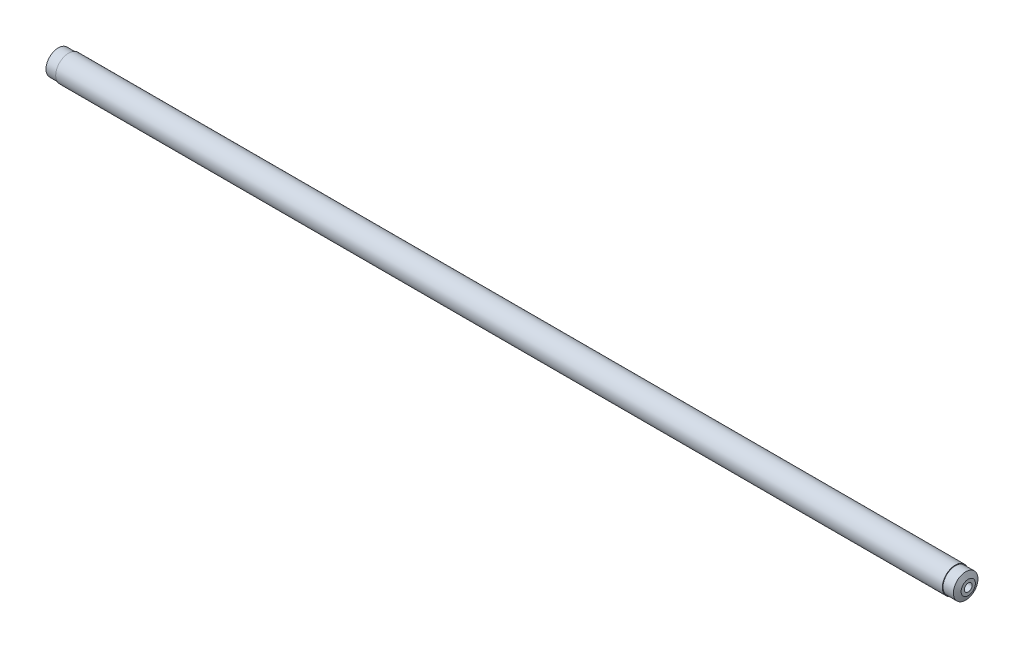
ISO-10303-21;
HEADER;
FILE_DESCRIPTION(('STEP AP214'),'2;1');
FILE_NAME('part.step','',(''),(''),'','','');
FILE_SCHEMA(('AUTOMOTIVE_DESIGN { 1 0 10303 214 1 1 1 1 }'));
ENDSEC;
DATA;
#1=APPLICATION_CONTEXT('core data for automotive mechanical design processes');
#2=APPLICATION_PROTOCOL_DEFINITION('international standard','automotive_design',2000,#1);
#3=PRODUCT_CONTEXT('',#1,'mechanical');
#4=PRODUCT('Part','Part','',(#3));
#5=PRODUCT_RELATED_PRODUCT_CATEGORY('part','',(#4));
#6=PRODUCT_DEFINITION_FORMATION('','',#4);
#7=PRODUCT_DEFINITION_CONTEXT('part definition',#1,'design');
#8=PRODUCT_DEFINITION('design','',#6,#7);
#9=PRODUCT_DEFINITION_SHAPE('','',#8);
#10=(LENGTH_UNIT() NAMED_UNIT(*) SI_UNIT(.MILLI.,.METRE.));
#11=(NAMED_UNIT(*) PLANE_ANGLE_UNIT() SI_UNIT($,.RADIAN.));
#12=(NAMED_UNIT(*) SI_UNIT($,.STERADIAN.) SOLID_ANGLE_UNIT());
#13=UNCERTAINTY_MEASURE_WITH_UNIT(LENGTH_MEASURE(1.E-05),#10,'distance_accuracy_value','');
#14=(GEOMETRIC_REPRESENTATION_CONTEXT(3) GLOBAL_UNCERTAINTY_ASSIGNED_CONTEXT((#13)) GLOBAL_UNIT_ASSIGNED_CONTEXT((#10,
#11,#12)) REPRESENTATION_CONTEXT('',''));
#15=CARTESIAN_POINT('',(0.,0.,0.));
#16=DIRECTION('',(0.,0.,1.));
#17=DIRECTION('',(1.,0.,0.));
#18=AXIS2_PLACEMENT_3D('',#15,#16,#17);
#19=CARTESIAN_POINT('',(352.,0.,0.));
#20=DIRECTION('',(1.,0.,0.));
#21=DIRECTION('',(0.,0.,-1.));
#22=AXIS2_PLACEMENT_3D('',#19,#20,#21);
#23=PLANE('',#22);
#24=CARTESIAN_POINT('',(352.,0.,0.));
#25=DIRECTION('',(1.,0.,0.));
#26=DIRECTION('',(0.,0.,-1.));
#27=AXIS2_PLACEMENT_3D('',#24,#25,#26);
#28=CIRCLE('',#27,5.5);
#29=CARTESIAN_POINT('',(352.,0.,-5.5));
#30=VERTEX_POINT('',#29);
#31=EDGE_CURVE('E46',#30,#30,#28,.T.);
#32=ORIENTED_EDGE('',*,*,#31,.T.);
#33=EDGE_LOOP('',(#32));
#34=FACE_BOUND('',#33,.T.);
#35=CARTESIAN_POINT('',(352.,0.,0.));
#36=DIRECTION('',(-1.,0.,0.));
#37=DIRECTION('',(0.,0.,1.));
#38=AXIS2_PLACEMENT_3D('',#35,#36,#37);
#39=CIRCLE('',#38,2.99999999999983);
#40=CARTESIAN_POINT('',(352.,0.,2.99999999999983));
#41=VERTEX_POINT('',#40);
#42=EDGE_CURVE('E83',#41,#41,#39,.T.);
#43=ORIENTED_EDGE('',*,*,#42,.T.);
#44=EDGE_LOOP('',(#43));
#45=FACE_BOUND('',#44,.T.);
#46=ADVANCED_FACE('F38',(#34,#45),#23,.T.);
#47=CARTESIAN_POINT('',(352.,0.,0.));
#48=DIRECTION('',(1.,0.,0.));
#49=DIRECTION('',(0.,0.,-1.));
#50=AXIS2_PLACEMENT_3D('',#47,#48,#49);
#51=CYLINDRICAL_SURFACE('',#50,9.5);
#52=CARTESIAN_POINT('',(342.,0.,0.));
#53=DIRECTION('',(1.,0.,0.));
#54=DIRECTION('',(0.,0.,-1.));
#55=AXIS2_PLACEMENT_3D('',#52,#53,#54);
#56=CIRCLE('',#55,9.5);
#57=CARTESIAN_POINT('',(342.,0.,-9.5));
#58=VERTEX_POINT('',#57);
#59=EDGE_CURVE('E76',#58,#58,#56,.T.);
#60=ORIENTED_EDGE('',*,*,#59,.T.);
#61=EDGE_LOOP('',(#60));
#62=FACE_BOUND('',#61,.T.);
#63=CARTESIAN_POINT('',(350.,0.,0.));
#64=DIRECTION('',(1.,0.,0.));
#65=DIRECTION('',(0.,0.,-1.));
#66=AXIS2_PLACEMENT_3D('',#63,#64,#65);
#67=CIRCLE('',#66,9.5);
#68=CARTESIAN_POINT('',(350.,0.,-9.5));
#69=VERTEX_POINT('',#68);
#70=EDGE_CURVE('E10',#69,#69,#67,.T.);
#71=ORIENTED_EDGE('',*,*,#70,.F.);
#72=EDGE_LOOP('',(#71));
#73=FACE_BOUND('',#72,.T.);
#74=ADVANCED_FACE('F40',(#62,#73),#51,.T.);
#75=CARTESIAN_POINT('',(352.,0.,0.));
#76=DIRECTION('',(-1.,0.,0.));
#77=DIRECTION('',(0.,0.,1.));
#78=AXIS2_PLACEMENT_3D('',#75,#76,#77);
#79=CONICAL_SURFACE('',#78,5.5,1.10714871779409);
#80=ORIENTED_EDGE('',*,*,#70,.T.);
#81=EDGE_LOOP('',(#80));
#82=FACE_BOUND('',#81,.T.);
#83=ORIENTED_EDGE('',*,*,#31,.F.);
#84=EDGE_LOOP('',(#83));
#85=FACE_BOUND('',#84,.T.);
#86=ADVANCED_FACE('F99',(#82,#85),#79,.T.);
#87=CARTESIAN_POINT('',(-352.,0.,0.));
#88=DIRECTION('',(-1.,0.,0.));
#89=DIRECTION('',(0.,0.,1.));
#90=AXIS2_PLACEMENT_3D('',#87,#88,#89);
#91=PLANE('',#90);
#92=CARTESIAN_POINT('',(-352.,0.,0.));
#93=DIRECTION('',(-1.,0.,0.));
#94=DIRECTION('',(0.,0.,1.));
#95=AXIS2_PLACEMENT_3D('',#92,#93,#94);
#96=CIRCLE('',#95,2.99999999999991);
#97=CARTESIAN_POINT('',(-352.,0.,2.99999999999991));
#98=VERTEX_POINT('',#97);
#99=EDGE_CURVE('E79',#98,#98,#96,.T.);
#100=ORIENTED_EDGE('',*,*,#99,.F.);
#101=EDGE_LOOP('',(#100));
#102=FACE_BOUND('',#101,.T.);
#103=CARTESIAN_POINT('',(-352.,0.,0.));
#104=DIRECTION('',(1.,0.,0.));
#105=DIRECTION('',(0.,0.,-1.));
#106=AXIS2_PLACEMENT_3D('',#103,#104,#105);
#107=CIRCLE('',#106,5.5);
#108=CARTESIAN_POINT('',(-352.,0.,-5.5));
#109=VERTEX_POINT('',#108);
#110=EDGE_CURVE('E53',#109,#109,#107,.T.);
#111=ORIENTED_EDGE('',*,*,#110,.F.);
#112=EDGE_LOOP('',(#111));
#113=FACE_BOUND('',#112,.T.);
#114=ADVANCED_FACE('F95',(#102,#113),#91,.T.);
#115=CARTESIAN_POINT('',(-350.,0.,0.));
#116=DIRECTION('',(1.,0.,0.));
#117=DIRECTION('',(0.,0.,-1.));
#118=AXIS2_PLACEMENT_3D('',#115,#116,#117);
#119=CONICAL_SURFACE('',#118,9.5,1.10714871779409);
#120=ORIENTED_EDGE('',*,*,#110,.T.);
#121=EDGE_LOOP('',(#120));
#122=FACE_BOUND('',#121,.T.);
#123=CARTESIAN_POINT('',(-350.,0.,0.));
#124=DIRECTION('',(1.,0.,0.));
#125=DIRECTION('',(0.,0.,-1.));
#126=AXIS2_PLACEMENT_3D('',#123,#124,#125);
#127=CIRCLE('',#126,9.5);
#128=CARTESIAN_POINT('',(-350.,0.,-9.5));
#129=VERTEX_POINT('',#128);
#130=EDGE_CURVE('E59',#129,#129,#127,.T.);
#131=ORIENTED_EDGE('',*,*,#130,.F.);
#132=EDGE_LOOP('',(#131));
#133=FACE_BOUND('',#132,.T.);
#134=ADVANCED_FACE('F98',(#122,#133),#119,.T.);
#135=CARTESIAN_POINT('',(352.,0.,0.));
#136=DIRECTION('',(1.,0.,0.));
#137=DIRECTION('',(0.,0.,-1.));
#138=AXIS2_PLACEMENT_3D('',#135,#136,#137);
#139=CYLINDRICAL_SURFACE('',#138,9.5);
#140=ORIENTED_EDGE('',*,*,#130,.T.);
#141=EDGE_LOOP('',(#140));
#142=FACE_BOUND('',#141,.T.);
#143=CARTESIAN_POINT('',(-342.,0.,0.));
#144=DIRECTION('',(1.,0.,0.));
#145=DIRECTION('',(0.,0.,-1.));
#146=AXIS2_PLACEMENT_3D('',#143,#144,#145);
#147=CIRCLE('',#146,9.5);
#148=CARTESIAN_POINT('',(-342.,0.,-9.5));
#149=VERTEX_POINT('',#148);
#150=EDGE_CURVE('E65',#149,#149,#147,.T.);
#151=ORIENTED_EDGE('',*,*,#150,.F.);
#152=EDGE_LOOP('',(#151));
#153=FACE_BOUND('',#152,.T.);
#154=ADVANCED_FACE('F105',(#142,#153),#139,.T.);
#155=CARTESIAN_POINT('',(-342.,9.49999999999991,0.));
#156=DIRECTION('',(-1.,0.,0.));
#157=DIRECTION('',(0.,0.,1.));
#158=AXIS2_PLACEMENT_3D('',#155,#156,#157);
#159=PLANE('',#158);
#160=ORIENTED_EDGE('',*,*,#150,.T.);
#161=EDGE_LOOP('',(#160));
#162=FACE_BOUND('',#161,.T.);
#163=CARTESIAN_POINT('',(-342.,0.,0.));
#164=DIRECTION('',(1.,0.,0.));
#165=DIRECTION('',(0.,0.,-1.));
#166=AXIS2_PLACEMENT_3D('',#163,#164,#165);
#167=CIRCLE('',#166,9.99999999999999);
#168=CARTESIAN_POINT('',(-342.,0.,-9.99999999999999));
#169=VERTEX_POINT('',#168);
#170=EDGE_CURVE('E69',#169,#169,#167,.T.);
#171=ORIENTED_EDGE('',*,*,#170,.F.);
#172=EDGE_LOOP('',(#171));
#173=FACE_BOUND('',#172,.T.);
#174=ADVANCED_FACE('F111',(#162,#173),#159,.T.);
#175=CARTESIAN_POINT('',(352.,0.,0.));
#176=DIRECTION('',(1.,0.,0.));
#177=DIRECTION('',(0.,0.,-1.));
#178=AXIS2_PLACEMENT_3D('',#175,#176,#177);
#179=CYLINDRICAL_SURFACE('',#178,9.99999999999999);
#180=ORIENTED_EDGE('',*,*,#170,.T.);
#181=EDGE_LOOP('',(#180));
#182=FACE_BOUND('',#181,.T.);
#183=CARTESIAN_POINT('',(342.,0.,0.));
#184=DIRECTION('',(1.,0.,0.));
#185=DIRECTION('',(0.,0.,-1.));
#186=AXIS2_PLACEMENT_3D('',#183,#184,#185);
#187=CIRCLE('',#186,9.99999999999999);
#188=CARTESIAN_POINT('',(342.,0.,-9.99999999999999));
#189=VERTEX_POINT('',#188);
#190=EDGE_CURVE('E72',#189,#189,#187,.T.);
#191=ORIENTED_EDGE('',*,*,#190,.F.);
#192=EDGE_LOOP('',(#191));
#193=FACE_BOUND('',#192,.T.);
#194=ADVANCED_FACE('F117',(#182,#193),#179,.T.);
#195=CARTESIAN_POINT('',(342.,9.49999999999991,0.));
#196=DIRECTION('',(1.,0.,0.));
#197=DIRECTION('',(0.,0.,-1.));
#198=AXIS2_PLACEMENT_3D('',#195,#196,#197);
#199=PLANE('',#198);
#200=ORIENTED_EDGE('',*,*,#190,.T.);
#201=EDGE_LOOP('',(#200));
#202=FACE_BOUND('',#201,.T.);
#203=ORIENTED_EDGE('',*,*,#59,.F.);
#204=EDGE_LOOP('',(#203));
#205=FACE_BOUND('',#204,.T.);
#206=ADVANCED_FACE('F91',(#202,#205),#199,.T.);
#207=CARTESIAN_POINT('',(-352.,0.,0.));
#208=DIRECTION('',(-1.,0.,0.));
#209=DIRECTION('',(0.,0.,1.));
#210=AXIS2_PLACEMENT_3D('',#207,#208,#209);
#211=CYLINDRICAL_SURFACE('',#210,2.99999999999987);
#212=ORIENTED_EDGE('',*,*,#42,.F.);
#213=EDGE_LOOP('',(#212));
#214=FACE_BOUND('',#213,.T.);
#215=ORIENTED_EDGE('',*,*,#99,.T.);
#216=EDGE_LOOP('',(#215));
#217=FACE_BOUND('',#216,.T.);
#218=ADVANCED_FACE('F88',(#214,#217),#211,.F.);
#219=CLOSED_SHELL('',(#46,#74,#86,#114,#134,#154,#174,#194,#206,#218));
#220=MANIFOLD_SOLID_BREP('B2',#219);
#221=ADVANCED_BREP_SHAPE_REPRESENTATION('',(#18,#220),#14);
#222=SHAPE_DEFINITION_REPRESENTATION(#9,#221);
ENDSEC;
END-ISO-10303-21;
